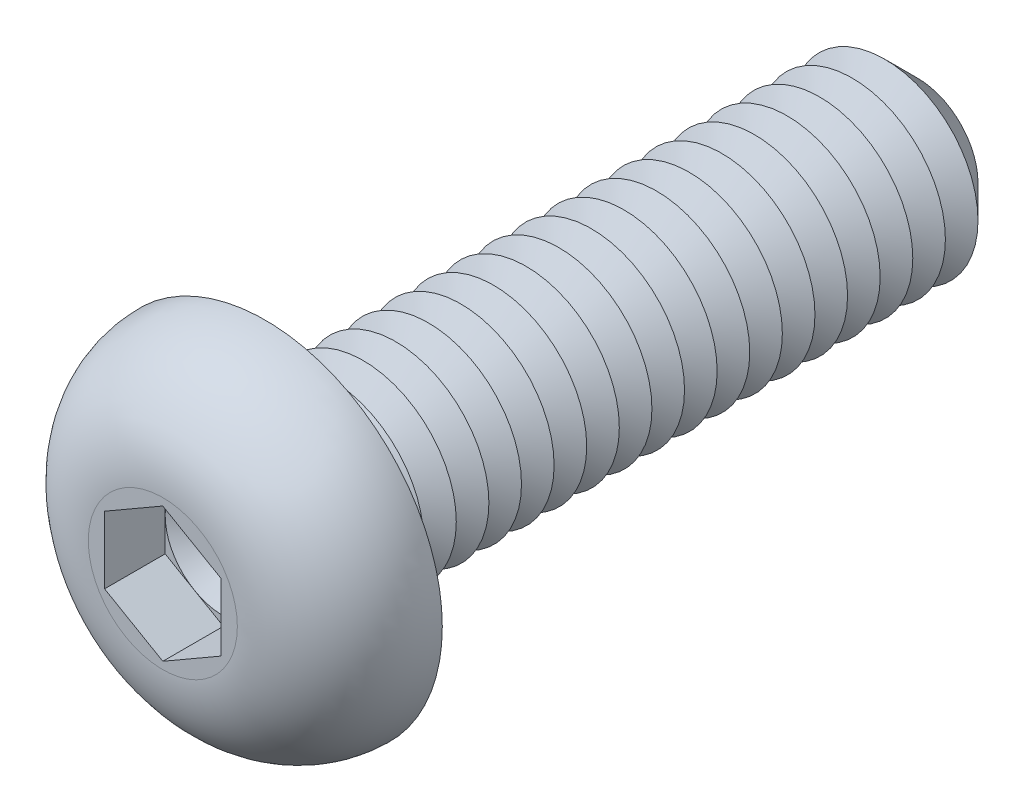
ISO-10303-21;
HEADER;
FILE_DESCRIPTION(('STEP AP214'),'2;1');
FILE_NAME('part.step','',(''),(''),'','','');
FILE_SCHEMA(('AUTOMOTIVE_DESIGN { 1 0 10303 214 1 1 1 1 }'));
ENDSEC;
DATA;
#1=APPLICATION_CONTEXT('core data for automotive mechanical design processes');
#2=APPLICATION_PROTOCOL_DEFINITION('international standard','automotive_design',2000,#1);
#3=PRODUCT_CONTEXT('',#1,'mechanical');
#4=PRODUCT('Part','Part','',(#3));
#5=PRODUCT_RELATED_PRODUCT_CATEGORY('part','',(#4));
#6=PRODUCT_DEFINITION_FORMATION('','',#4);
#7=PRODUCT_DEFINITION_CONTEXT('part definition',#1,'design');
#8=PRODUCT_DEFINITION('design','',#6,#7);
#9=PRODUCT_DEFINITION_SHAPE('','',#8);
#10=(LENGTH_UNIT() NAMED_UNIT(*) SI_UNIT(.MILLI.,.METRE.));
#11=(NAMED_UNIT(*) PLANE_ANGLE_UNIT() SI_UNIT($,.RADIAN.));
#12=(NAMED_UNIT(*) SI_UNIT($,.STERADIAN.) SOLID_ANGLE_UNIT());
#13=UNCERTAINTY_MEASURE_WITH_UNIT(LENGTH_MEASURE(1.E-05),#10,'distance_accuracy_value','');
#14=(GEOMETRIC_REPRESENTATION_CONTEXT(3) GLOBAL_UNCERTAINTY_ASSIGNED_CONTEXT((#13)) GLOBAL_UNIT_ASSIGNED_CONTEXT((#10,
#11,#12)) REPRESENTATION_CONTEXT('',''));
#15=CARTESIAN_POINT('',(0.,0.,0.));
#16=DIRECTION('',(0.,0.,1.));
#17=DIRECTION('',(1.,0.,0.));
#18=AXIS2_PLACEMENT_3D('',#15,#16,#17);
#19=CARTESIAN_POINT('',(0.,0.,0.900000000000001));
#20=DIRECTION('',(0.,0.,1.));
#21=DIRECTION('',(1.,0.,0.));
#22=AXIS2_PLACEMENT_3D('',#19,#20,#21);
#23=PLANE('',#22);
#24=CARTESIAN_POINT('',(0.,0.,0.900000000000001));
#25=DIRECTION('',(0.,0.,1.));
#26=DIRECTION('',(1.,0.,0.));
#27=AXIS2_PLACEMENT_3D('',#24,#25,#26);
#28=CIRCLE('',#27,1.25);
#29=CARTESIAN_POINT('',(1.25,0.,0.900000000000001));
#30=VERTEX_POINT('',#29);
#31=CARTESIAN_POINT('',(0.625,1.08253175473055,0.900000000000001));
#32=VERTEX_POINT('',#31);
#33=EDGE_CURVE('E117',#30,#32,#28,.T.);
#34=ORIENTED_EDGE('',*,*,#33,.F.);
#35=DIRECTION('',(0.,1.,0.));
#36=VECTOR('',#35,1.);
#37=CARTESIAN_POINT('',(1.25,-0.721687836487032,0.900000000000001));
#38=LINE('',#37,#36);
#39=CARTESIAN_POINT('',(1.25,0.721687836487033,0.900000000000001));
#40=VERTEX_POINT('',#39);
#41=EDGE_CURVE('E140',#30,#40,#38,.T.);
#42=ORIENTED_EDGE('',*,*,#41,.T.);
#43=DIRECTION('',(-0.866025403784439,0.5,0.));
#44=VECTOR('',#43,1.);
#45=CARTESIAN_POINT('',(1.25,0.721687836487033,0.900000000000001));
#46=LINE('',#45,#44);
#47=EDGE_CURVE('E135',#40,#32,#46,.T.);
#48=ORIENTED_EDGE('',*,*,#47,.T.);
#49=EDGE_LOOP('',(#34,#42,#48));
#50=FACE_BOUND('',#49,.T.);
#51=ADVANCED_FACE('F39',(#50),#23,.T.);
#52=CARTESIAN_POINT('',(0.,0.,0.900000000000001));
#53=DIRECTION('',(0.,0.,1.));
#54=DIRECTION('',(1.,0.,0.));
#55=AXIS2_PLACEMENT_3D('',#52,#53,#54);
#56=CIRCLE('',#55,1.25);
#57=CARTESIAN_POINT('',(-0.625,1.08253175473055,0.900000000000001));
#58=VERTEX_POINT('',#57);
#59=EDGE_CURVE('E11',#32,#58,#56,.T.);
#60=ORIENTED_EDGE('',*,*,#59,.F.);
#61=CARTESIAN_POINT('',(0.,1.44337567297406,0.900000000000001));
#62=VERTEX_POINT('',#61);
#63=EDGE_CURVE('E130',#32,#62,#46,.T.);
#64=ORIENTED_EDGE('',*,*,#63,.T.);
#65=DIRECTION('',(-0.866025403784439,-0.5,0.));
#66=VECTOR('',#65,1.);
#67=CARTESIAN_POINT('',(0.,1.44337567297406,0.900000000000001));
#68=LINE('',#67,#66);
#69=EDGE_CURVE('E132',#62,#58,#68,.T.);
#70=ORIENTED_EDGE('',*,*,#69,.T.);
#71=EDGE_LOOP('',(#60,#64,#70));
#72=FACE_BOUND('',#71,.T.);
#73=ADVANCED_FACE('F129',(#72),#23,.T.);
#74=CARTESIAN_POINT('',(-1.25,0.,0.900000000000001));
#75=VERTEX_POINT('',#74);
#76=EDGE_CURVE('E49',#58,#75,#56,.T.);
#77=ORIENTED_EDGE('',*,*,#76,.F.);
#78=CARTESIAN_POINT('',(-1.25,0.721687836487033,0.900000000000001));
#79=VERTEX_POINT('',#78);
#80=EDGE_CURVE('E143',#58,#79,#68,.T.);
#81=ORIENTED_EDGE('',*,*,#80,.T.);
#82=DIRECTION('',(0.,-1.,0.));
#83=VECTOR('',#82,1.);
#84=CARTESIAN_POINT('',(-1.25,0.721687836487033,0.900000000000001));
#85=LINE('',#84,#83);
#86=EDGE_CURVE('E154',#79,#75,#85,.T.);
#87=ORIENTED_EDGE('',*,*,#86,.T.);
#88=EDGE_LOOP('',(#77,#81,#87));
#89=FACE_BOUND('',#88,.T.);
#90=ADVANCED_FACE('F250',(#89),#23,.T.);
#91=CARTESIAN_POINT('',(-0.625,-1.08253175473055,0.900000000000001));
#92=VERTEX_POINT('',#91);
#93=EDGE_CURVE('E233',#75,#92,#56,.T.);
#94=ORIENTED_EDGE('',*,*,#93,.F.);
#95=CARTESIAN_POINT('',(-1.25,-0.721687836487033,0.900000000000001));
#96=VERTEX_POINT('',#95);
#97=EDGE_CURVE('E153',#75,#96,#85,.T.);
#98=ORIENTED_EDGE('',*,*,#97,.T.);
#99=DIRECTION('',(0.866025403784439,-0.5,0.));
#100=VECTOR('',#99,1.);
#101=CARTESIAN_POINT('',(-1.25,-0.721687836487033,0.900000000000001));
#102=LINE('',#101,#100);
#103=EDGE_CURVE('E159',#96,#92,#102,.T.);
#104=ORIENTED_EDGE('',*,*,#103,.T.);
#105=EDGE_LOOP('',(#94,#98,#104));
#106=FACE_BOUND('',#105,.T.);
#107=ADVANCED_FACE('F243',(#106),#23,.T.);
#108=CARTESIAN_POINT('',(0.625,-1.08253175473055,0.900000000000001));
#109=VERTEX_POINT('',#108);
#110=EDGE_CURVE('E56',#92,#109,#56,.T.);
#111=ORIENTED_EDGE('',*,*,#110,.F.);
#112=CARTESIAN_POINT('',(0.,-1.44337567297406,0.900000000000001));
#113=VERTEX_POINT('',#112);
#114=EDGE_CURVE('E158',#92,#113,#102,.T.);
#115=ORIENTED_EDGE('',*,*,#114,.T.);
#116=DIRECTION('',(0.866025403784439,0.5,0.));
#117=VECTOR('',#116,1.);
#118=CARTESIAN_POINT('',(0.,-1.44337567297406,0.900000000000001));
#119=LINE('',#118,#117);
#120=EDGE_CURVE('E164',#113,#109,#119,.T.);
#121=ORIENTED_EDGE('',*,*,#120,.T.);
#122=EDGE_LOOP('',(#111,#115,#121));
#123=FACE_BOUND('',#122,.T.);
#124=ADVANCED_FACE('F425',(#123),#23,.T.);
#125=CARTESIAN_POINT('',(0.,0.,-14.));
#126=DIRECTION('',(0.,0.,1.));
#127=DIRECTION('',(1.,0.,0.));
#128=AXIS2_PLACEMENT_3D('',#125,#126,#127);
#129=CYLINDRICAL_SURFACE('',#128,2.);
#130=CARTESIAN_POINT('',(0.,0.,-0.3));
#131=DIRECTION('',(0.,0.,1.));
#132=DIRECTION('',(1.,0.,0.));
#133=AXIS2_PLACEMENT_3D('',#130,#131,#132);
#134=CIRCLE('',#133,2.);
#135=CARTESIAN_POINT('',(2.,0.,-0.3));
#136=VERTEX_POINT('',#135);
#137=EDGE_CURVE('E221',#136,#136,#134,.F.);
#138=ORIENTED_EDGE('',*,*,#137,.T.);
#139=EDGE_LOOP('',(#138));
#140=FACE_BOUND('',#139,.T.);
#141=CARTESIAN_POINT('',(0.,0.,-0.699999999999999));
#142=DIRECTION('',(0.,0.,1.));
#143=DIRECTION('',(1.,0.,0.));
#144=AXIS2_PLACEMENT_3D('',#141,#142,#143);
#145=CIRCLE('',#144,2.);
#146=CARTESIAN_POINT('',(2.,0.,-0.699999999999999));
#147=VERTEX_POINT('',#146);
#148=EDGE_CURVE('E149',#147,#147,#145,.T.);
#149=ORIENTED_EDGE('',*,*,#148,.T.);
#150=EDGE_LOOP('',(#149));
#151=FACE_BOUND('',#150,.T.);
#152=ADVANCED_FACE('F409',(#140,#151),#129,.T.);
#153=CARTESIAN_POINT('',(0.,3.8,0.));
#154=DIRECTION('',(0.,0.,1.));
#155=DIRECTION('',(1.,0.,0.));
#156=AXIS2_PLACEMENT_3D('',#153,#154,#155);
#157=PLANE('',#156);
#158=CARTESIAN_POINT('',(0.,0.,0.));
#159=DIRECTION('',(0.,0.,1.));
#160=DIRECTION('',(1.,0.,0.));
#161=AXIS2_PLACEMENT_3D('',#158,#159,#160);
#162=CIRCLE('',#161,2.3);
#163=CARTESIAN_POINT('',(2.3,0.,0.));
#164=VERTEX_POINT('',#163);
#165=EDGE_CURVE('E224',#164,#164,#162,.T.);
#166=ORIENTED_EDGE('',*,*,#165,.T.);
#167=EDGE_LOOP('',(#166));
#168=FACE_BOUND('',#167,.T.);
#169=CARTESIAN_POINT('',(0.,0.,0.));
#170=DIRECTION('',(0.,0.,1.));
#171=DIRECTION('',(1.,0.,0.));
#172=AXIS2_PLACEMENT_3D('',#169,#170,#171);
#173=CIRCLE('',#172,3.8);
#174=CARTESIAN_POINT('',(3.8,0.,0.));
#175=VERTEX_POINT('',#174);
#176=EDGE_CURVE('E195',#175,#175,#173,.T.);
#177=ORIENTED_EDGE('',*,*,#176,.F.);
#178=EDGE_LOOP('',(#177));
#179=FACE_BOUND('',#178,.T.);
#180=ADVANCED_FACE('F455',(#168,#179),#157,.F.);
#181=CARTESIAN_POINT('',(0.,0.,2.2));
#182=DIRECTION('',(0.,0.,-1.));
#183=DIRECTION('',(-1.,0.,0.));
#184=AXIS2_PLACEMENT_3D('',#181,#182,#183);
#185=PLANE('',#184);
#186=DIRECTION('',(-0.866025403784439,-0.5,0.));
#187=VECTOR('',#186,1.);
#188=CARTESIAN_POINT('',(0.,1.44337567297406,2.2));
#189=LINE('',#188,#187);
#190=CARTESIAN_POINT('',(0.,1.44337567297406,2.2));
#191=VERTEX_POINT('',#190);
#192=CARTESIAN_POINT('',(-1.25,0.721687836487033,2.2));
#193=VERTEX_POINT('',#192);
#194=EDGE_CURVE('E174',#191,#193,#189,.T.);
#195=ORIENTED_EDGE('',*,*,#194,.F.);
#196=DIRECTION('',(-0.866025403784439,0.5,0.));
#197=VECTOR('',#196,1.);
#198=CARTESIAN_POINT('',(1.25,0.721687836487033,2.2));
#199=LINE('',#198,#197);
#200=CARTESIAN_POINT('',(1.25,0.721687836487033,2.2));
#201=VERTEX_POINT('',#200);
#202=EDGE_CURVE('E64',#201,#191,#199,.T.);
#203=ORIENTED_EDGE('',*,*,#202,.F.);
#204=DIRECTION('',(0.,1.,0.));
#205=VECTOR('',#204,1.);
#206=CARTESIAN_POINT('',(1.25,-0.721687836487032,2.2));
#207=LINE('',#206,#205);
#208=CARTESIAN_POINT('',(1.25,-0.721687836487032,2.2));
#209=VERTEX_POINT('',#208);
#210=EDGE_CURVE('E138',#209,#201,#207,.T.);
#211=ORIENTED_EDGE('',*,*,#210,.F.);
#212=DIRECTION('',(0.866025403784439,0.5,0.));
#213=VECTOR('',#212,1.);
#214=CARTESIAN_POINT('',(0.,-1.44337567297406,2.2));
#215=LINE('',#214,#213);
#216=CARTESIAN_POINT('',(0.,-1.44337567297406,2.2));
#217=VERTEX_POINT('',#216);
#218=EDGE_CURVE('E186',#217,#209,#215,.T.);
#219=ORIENTED_EDGE('',*,*,#218,.F.);
#220=DIRECTION('',(0.866025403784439,-0.5,0.));
#221=VECTOR('',#220,1.);
#222=CARTESIAN_POINT('',(-1.25,-0.721687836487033,2.2));
#223=LINE('',#222,#221);
#224=CARTESIAN_POINT('',(-1.25,-0.721687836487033,2.2));
#225=VERTEX_POINT('',#224);
#226=EDGE_CURVE('E182',#225,#217,#223,.T.);
#227=ORIENTED_EDGE('',*,*,#226,.F.);
#228=DIRECTION('',(0.,-1.,0.));
#229=VECTOR('',#228,1.);
#230=CARTESIAN_POINT('',(-1.25,0.721687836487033,2.2));
#231=LINE('',#230,#229);
#232=EDGE_CURVE('E178',#193,#225,#231,.T.);
#233=ORIENTED_EDGE('',*,*,#232,.F.);
#234=EDGE_LOOP('',(#195,#203,#211,#219,#227,#233));
#235=FACE_BOUND('',#234,.T.);
#236=CARTESIAN_POINT('',(0.,0.,2.2));
#237=DIRECTION('',(0.,0.,1.));
#238=DIRECTION('',(1.,0.,0.));
#239=AXIS2_PLACEMENT_3D('',#236,#237,#238);
#240=CIRCLE('',#239,1.6);
#241=CARTESIAN_POINT('',(1.6,0.,2.2));
#242=VERTEX_POINT('',#241);
#243=EDGE_CURVE('E213',#242,#242,#240,.T.);
#244=ORIENTED_EDGE('',*,*,#243,.T.);
#245=EDGE_LOOP('',(#244));
#246=FACE_BOUND('',#245,.T.);
#247=ADVANCED_FACE('F259',(#235,#246),#185,.F.);
#248=CARTESIAN_POINT('',(0.,0.,0.));
#249=DIRECTION('',(0.,0.,1.));
#250=DIRECTION('',(1.,0.,0.));
#251=AXIS2_PLACEMENT_3D('',#248,#249,#250);
#252=DEGENERATE_TOROIDAL_SURFACE('',#251,1.6,2.2,.T.);
#253=ORIENTED_EDGE('',*,*,#243,.F.);
#254=EDGE_LOOP('',(#253));
#255=FACE_BOUND('',#254,.T.);
#256=ORIENTED_EDGE('',*,*,#176,.T.);
#257=EDGE_LOOP('',(#256));
#258=FACE_BOUND('',#257,.T.);
#259=ADVANCED_FACE('F449',(#255,#258),#252,.T.);
#260=CARTESIAN_POINT('',(1.25,0.721687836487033,0.900000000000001));
#261=DIRECTION('',(0.5,0.866025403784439,0.));
#262=DIRECTION('',(-0.866025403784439,0.5,0.));
#263=AXIS2_PLACEMENT_3D('',#260,#261,#262);
#264=PLANE('',#263);
#265=ORIENTED_EDGE('',*,*,#202,.T.);
#266=DIRECTION('',(0.,0.,1.));
#267=VECTOR('',#266,1.);
#268=CARTESIAN_POINT('',(0.,1.44337567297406,0.900000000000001));
#269=LINE('',#268,#267);
#270=EDGE_CURVE('E136',#62,#191,#269,.T.);
#271=ORIENTED_EDGE('',*,*,#270,.F.);
#272=ORIENTED_EDGE('',*,*,#63,.F.);
#273=ORIENTED_EDGE('',*,*,#47,.F.);
#274=DIRECTION('',(0.,0.,1.));
#275=VECTOR('',#274,1.);
#276=CARTESIAN_POINT('',(1.25,0.721687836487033,0.900000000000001));
#277=LINE('',#276,#275);
#278=EDGE_CURVE('E193',#40,#201,#277,.T.);
#279=ORIENTED_EDGE('',*,*,#278,.T.);
#280=EDGE_LOOP('',(#265,#271,#272,#273,#279));
#281=FACE_BOUND('',#280,.T.);
#282=ADVANCED_FACE('F134',(#281),#264,.F.);
#283=CARTESIAN_POINT('',(1.25,-0.721687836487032,0.900000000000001));
#284=DIRECTION('',(1.,0.,0.));
#285=DIRECTION('',(0.,1.,0.));
#286=AXIS2_PLACEMENT_3D('',#283,#284,#285);
#287=PLANE('',#286);
#288=ORIENTED_EDGE('',*,*,#210,.T.);
#289=ORIENTED_EDGE('',*,*,#278,.F.);
#290=ORIENTED_EDGE('',*,*,#41,.F.);
#291=CARTESIAN_POINT('',(1.25,-0.721687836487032,0.900000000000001));
#292=VERTEX_POINT('',#291);
#293=EDGE_CURVE('E168',#292,#30,#38,.T.);
#294=ORIENTED_EDGE('',*,*,#293,.F.);
#295=DIRECTION('',(0.,0.,1.));
#296=VECTOR('',#295,1.);
#297=CARTESIAN_POINT('',(1.25,-0.721687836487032,0.900000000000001));
#298=LINE('',#297,#296);
#299=EDGE_CURVE('E196',#292,#209,#298,.T.);
#300=ORIENTED_EDGE('',*,*,#299,.T.);
#301=EDGE_LOOP('',(#288,#289,#290,#294,#300));
#302=FACE_BOUND('',#301,.T.);
#303=ADVANCED_FACE('F433',(#302),#287,.F.);
#304=CARTESIAN_POINT('',(0.,-1.44337567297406,0.900000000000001));
#305=DIRECTION('',(0.5,-0.866025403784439,0.));
#306=DIRECTION('',(0.866025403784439,0.5,0.));
#307=AXIS2_PLACEMENT_3D('',#304,#305,#306);
#308=PLANE('',#307);
#309=ORIENTED_EDGE('',*,*,#218,.T.);
#310=ORIENTED_EDGE('',*,*,#299,.F.);
#311=EDGE_CURVE('E163',#109,#292,#119,.T.);
#312=ORIENTED_EDGE('',*,*,#311,.F.);
#313=ORIENTED_EDGE('',*,*,#120,.F.);
#314=DIRECTION('',(0.,0.,1.));
#315=VECTOR('',#314,1.);
#316=CARTESIAN_POINT('',(0.,-1.44337567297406,0.900000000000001));
#317=LINE('',#316,#315);
#318=EDGE_CURVE('E199',#113,#217,#317,.T.);
#319=ORIENTED_EDGE('',*,*,#318,.T.);
#320=EDGE_LOOP('',(#309,#310,#312,#313,#319));
#321=FACE_BOUND('',#320,.T.);
#322=ADVANCED_FACE('F436',(#321),#308,.F.);
#323=CARTESIAN_POINT('',(-1.25,-0.721687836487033,0.900000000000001));
#324=DIRECTION('',(-0.5,-0.866025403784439,0.));
#325=DIRECTION('',(0.866025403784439,-0.5,0.));
#326=AXIS2_PLACEMENT_3D('',#323,#324,#325);
#327=PLANE('',#326);
#328=ORIENTED_EDGE('',*,*,#226,.T.);
#329=ORIENTED_EDGE('',*,*,#318,.F.);
#330=ORIENTED_EDGE('',*,*,#114,.F.);
#331=ORIENTED_EDGE('',*,*,#103,.F.);
#332=DIRECTION('',(0.,0.,1.));
#333=VECTOR('',#332,1.);
#334=CARTESIAN_POINT('',(-1.25,-0.721687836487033,0.900000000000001));
#335=LINE('',#334,#333);
#336=EDGE_CURVE('E202',#96,#225,#335,.T.);
#337=ORIENTED_EDGE('',*,*,#336,.T.);
#338=EDGE_LOOP('',(#328,#329,#330,#331,#337));
#339=FACE_BOUND('',#338,.T.);
#340=ADVANCED_FACE('F264',(#339),#327,.F.);
#341=CARTESIAN_POINT('',(-1.25,0.721687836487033,0.900000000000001));
#342=DIRECTION('',(-1.,0.,0.));
#343=DIRECTION('',(0.,0.,1.));
#344=AXIS2_PLACEMENT_3D('',#341,#342,#343);
#345=PLANE('',#344);
#346=ORIENTED_EDGE('',*,*,#232,.T.);
#347=ORIENTED_EDGE('',*,*,#336,.F.);
#348=ORIENTED_EDGE('',*,*,#97,.F.);
#349=ORIENTED_EDGE('',*,*,#86,.F.);
#350=DIRECTION('',(0.,0.,1.));
#351=VECTOR('',#350,1.);
#352=CARTESIAN_POINT('',(-1.25,0.721687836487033,0.900000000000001));
#353=LINE('',#352,#351);
#354=EDGE_CURVE('E205',#79,#193,#353,.T.);
#355=ORIENTED_EDGE('',*,*,#354,.T.);
#356=EDGE_LOOP('',(#346,#347,#348,#349,#355));
#357=FACE_BOUND('',#356,.T.);
#358=ADVANCED_FACE('F248',(#357),#345,.F.);
#359=CARTESIAN_POINT('',(0.,1.44337567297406,0.900000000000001));
#360=DIRECTION('',(-0.5,0.866025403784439,0.));
#361=DIRECTION('',(-0.866025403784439,-0.5,0.));
#362=AXIS2_PLACEMENT_3D('',#359,#360,#361);
#363=PLANE('',#362);
#364=ORIENTED_EDGE('',*,*,#194,.T.);
#365=ORIENTED_EDGE('',*,*,#354,.F.);
#366=ORIENTED_EDGE('',*,*,#80,.F.);
#367=ORIENTED_EDGE('',*,*,#69,.F.);
#368=ORIENTED_EDGE('',*,*,#270,.T.);
#369=EDGE_LOOP('',(#364,#365,#366,#367,#368));
#370=FACE_BOUND('',#369,.T.);
#371=ADVANCED_FACE('F253',(#370),#363,.F.);
#372=EDGE_CURVE('E43',#109,#30,#56,.T.);
#373=ORIENTED_EDGE('',*,*,#372,.F.);
#374=ORIENTED_EDGE('',*,*,#311,.T.);
#375=ORIENTED_EDGE('',*,*,#293,.T.);
#376=EDGE_LOOP('',(#373,#374,#375));
#377=FACE_BOUND('',#376,.T.);
#378=ADVANCED_FACE('F414',(#377),#23,.T.);
#379=CARTESIAN_POINT('',(0.,0.,-0.699999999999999));
#380=DIRECTION('',(0.,0.,1.));
#381=DIRECTION('',(1.,0.,0.));
#382=AXIS2_PLACEMENT_3D('',#379,#380,#381);
#383=CONICAL_SURFACE('',#382,2.,1.04719755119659);
#384=CARTESIAN_POINT('',(0.,0.,-1.05));
#385=DIRECTION('',(0.,0.,1.));
#386=DIRECTION('',(1.,0.,0.));
#387=AXIS2_PLACEMENT_3D('',#384,#385,#386);
#388=CIRCLE('',#387,1.3937822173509);
#389=CARTESIAN_POINT('',(1.3937822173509,0.,-1.05));
#390=VERTEX_POINT('',#389);
#391=EDGE_CURVE('E401',#390,#390,#388,.T.);
#392=ORIENTED_EDGE('',*,*,#391,.T.);
#393=EDGE_LOOP('',(#392));
#394=FACE_BOUND('',#393,.T.);
#395=ORIENTED_EDGE('',*,*,#148,.F.);
#396=EDGE_LOOP('',(#395));
#397=FACE_BOUND('',#396,.T.);
#398=ADVANCED_FACE('F411',(#394,#397),#383,.T.);
#399=CARTESIAN_POINT('',(0.,0.,-1.05));
#400=DIRECTION('',(0.,0.,-1.));
#401=DIRECTION('',(-1.,0.,0.));
#402=AXIS2_PLACEMENT_3D('',#399,#400,#401);
#403=CONICAL_SURFACE('',#402,1.3937822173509,1.0471975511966);
#404=CARTESIAN_POINT('',(0.,0.,-1.4));
#405=DIRECTION('',(0.,0.,1.));
#406=DIRECTION('',(1.,0.,0.));
#407=AXIS2_PLACEMENT_3D('',#404,#405,#406);
#408=CIRCLE('',#407,2.);
#409=CARTESIAN_POINT('',(2.,0.,-1.4));
#410=VERTEX_POINT('',#409);
#411=EDGE_CURVE('E399',#410,#410,#408,.T.);
#412=ORIENTED_EDGE('',*,*,#411,.T.);
#413=EDGE_LOOP('',(#412));
#414=FACE_BOUND('',#413,.T.);
#415=ORIENTED_EDGE('',*,*,#391,.F.);
#416=EDGE_LOOP('',(#415));
#417=FACE_BOUND('',#416,.T.);
#418=ADVANCED_FACE('F413',(#414,#417),#403,.T.);
#419=CARTESIAN_POINT('',(0.,0.,-1.4));
#420=DIRECTION('',(0.,0.,1.));
#421=DIRECTION('',(1.,0.,0.));
#422=AXIS2_PLACEMENT_3D('',#419,#420,#421);
#423=CONICAL_SURFACE('',#422,2.,1.04719755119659);
#424=CARTESIAN_POINT('',(0.,0.,-1.75));
#425=DIRECTION('',(0.,0.,1.));
#426=DIRECTION('',(1.,0.,0.));
#427=AXIS2_PLACEMENT_3D('',#424,#425,#426);
#428=CIRCLE('',#427,1.3937822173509);
#429=CARTESIAN_POINT('',(1.3937822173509,0.,-1.75));
#430=VERTEX_POINT('',#429);
#431=EDGE_CURVE('E334',#430,#430,#428,.T.);
#432=ORIENTED_EDGE('',*,*,#431,.T.);
#433=EDGE_LOOP('',(#432));
#434=FACE_BOUND('',#433,.T.);
#435=ORIENTED_EDGE('',*,*,#411,.F.);
#436=EDGE_LOOP('',(#435));
#437=FACE_BOUND('',#436,.T.);
#438=ADVANCED_FACE('F420',(#434,#437),#423,.T.);
#439=CARTESIAN_POINT('',(0.,0.,-1.75));
#440=DIRECTION('',(0.,0.,-1.));
#441=DIRECTION('',(-1.,0.,0.));
#442=AXIS2_PLACEMENT_3D('',#439,#440,#441);
#443=CONICAL_SURFACE('',#442,1.3937822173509,1.0471975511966);
#444=CARTESIAN_POINT('',(0.,0.,-2.1));
#445=DIRECTION('',(0.,0.,1.));
#446=DIRECTION('',(1.,0.,0.));
#447=AXIS2_PLACEMENT_3D('',#444,#445,#446);
#448=CIRCLE('',#447,2.);
#449=CARTESIAN_POINT('',(2.,0.,-2.1));
#450=VERTEX_POINT('',#449);
#451=EDGE_CURVE('E332',#450,#450,#448,.T.);
#452=ORIENTED_EDGE('',*,*,#451,.T.);
#453=EDGE_LOOP('',(#452));
#454=FACE_BOUND('',#453,.T.);
#455=ORIENTED_EDGE('',*,*,#431,.F.);
#456=EDGE_LOOP('',(#455));
#457=FACE_BOUND('',#456,.T.);
#458=ADVANCED_FACE('F601',(#454,#457),#443,.T.);
#459=CARTESIAN_POINT('',(0.,0.,-2.1));
#460=DIRECTION('',(0.,0.,1.));
#461=DIRECTION('',(1.,0.,0.));
#462=AXIS2_PLACEMENT_3D('',#459,#460,#461);
#463=CONICAL_SURFACE('',#462,2.,1.04719755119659);
#464=CARTESIAN_POINT('',(0.,0.,-2.45));
#465=DIRECTION('',(0.,0.,1.));
#466=DIRECTION('',(1.,0.,0.));
#467=AXIS2_PLACEMENT_3D('',#464,#465,#466);
#468=CIRCLE('',#467,1.3937822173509);
#469=CARTESIAN_POINT('',(1.3937822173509,0.,-2.45));
#470=VERTEX_POINT('',#469);
#471=EDGE_CURVE('E335',#470,#470,#468,.T.);
#472=ORIENTED_EDGE('',*,*,#471,.T.);
#473=EDGE_LOOP('',(#472));
#474=FACE_BOUND('',#473,.T.);
#475=ORIENTED_EDGE('',*,*,#451,.F.);
#476=EDGE_LOOP('',(#475));
#477=FACE_BOUND('',#476,.T.);
#478=ADVANCED_FACE('F597',(#474,#477),#463,.T.);
#479=CARTESIAN_POINT('',(0.,0.,-2.45));
#480=DIRECTION('',(0.,0.,-1.));
#481=DIRECTION('',(-1.,0.,0.));
#482=AXIS2_PLACEMENT_3D('',#479,#480,#481);
#483=CONICAL_SURFACE('',#482,1.3937822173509,1.0471975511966);
#484=CARTESIAN_POINT('',(0.,0.,-2.8));
#485=DIRECTION('',(0.,0.,1.));
#486=DIRECTION('',(1.,0.,0.));
#487=AXIS2_PLACEMENT_3D('',#484,#485,#486);
#488=CIRCLE('',#487,2.);
#489=CARTESIAN_POINT('',(2.,0.,-2.8));
#490=VERTEX_POINT('',#489);
#491=EDGE_CURVE('E349',#490,#490,#488,.T.);
#492=ORIENTED_EDGE('',*,*,#491,.T.);
#493=EDGE_LOOP('',(#492));
#494=FACE_BOUND('',#493,.T.);
#495=ORIENTED_EDGE('',*,*,#471,.F.);
#496=EDGE_LOOP('',(#495));
#497=FACE_BOUND('',#496,.T.);
#498=ADVANCED_FACE('F593',(#494,#497),#483,.T.);
#499=CARTESIAN_POINT('',(0.,0.,-2.8));
#500=DIRECTION('',(0.,0.,1.));
#501=DIRECTION('',(1.,0.,0.));
#502=AXIS2_PLACEMENT_3D('',#499,#500,#501);
#503=CONICAL_SURFACE('',#502,2.,1.04719755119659);
#504=CARTESIAN_POINT('',(0.,0.,-3.15));
#505=DIRECTION('',(0.,0.,1.));
#506=DIRECTION('',(1.,0.,0.));
#507=AXIS2_PLACEMENT_3D('',#504,#505,#506);
#508=CIRCLE('',#507,1.3937822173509);
#509=CARTESIAN_POINT('',(1.3937822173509,0.,-3.15));
#510=VERTEX_POINT('',#509);
#511=EDGE_CURVE('E346',#510,#510,#508,.T.);
#512=ORIENTED_EDGE('',*,*,#511,.T.);
#513=EDGE_LOOP('',(#512));
#514=FACE_BOUND('',#513,.T.);
#515=ORIENTED_EDGE('',*,*,#491,.F.);
#516=EDGE_LOOP('',(#515));
#517=FACE_BOUND('',#516,.T.);
#518=ADVANCED_FACE('F589',(#514,#517),#503,.T.);
#519=CARTESIAN_POINT('',(0.,0.,-3.15));
#520=DIRECTION('',(0.,0.,-1.));
#521=DIRECTION('',(-1.,0.,0.));
#522=AXIS2_PLACEMENT_3D('',#519,#520,#521);
#523=CONICAL_SURFACE('',#522,1.3937822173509,1.0471975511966);
#524=CARTESIAN_POINT('',(0.,0.,-3.5));
#525=DIRECTION('',(0.,0.,1.));
#526=DIRECTION('',(1.,0.,0.));
#527=AXIS2_PLACEMENT_3D('',#524,#525,#526);
#528=CIRCLE('',#527,2.);
#529=CARTESIAN_POINT('',(2.,0.,-3.5));
#530=VERTEX_POINT('',#529);
#531=EDGE_CURVE('E317',#530,#530,#528,.T.);
#532=ORIENTED_EDGE('',*,*,#531,.T.);
#533=EDGE_LOOP('',(#532));
#534=FACE_BOUND('',#533,.T.);
#535=ORIENTED_EDGE('',*,*,#511,.F.);
#536=EDGE_LOOP('',(#535));
#537=FACE_BOUND('',#536,.T.);
#538=ADVANCED_FACE('F585',(#534,#537),#523,.T.);
#539=CARTESIAN_POINT('',(0.,0.,-3.5));
#540=DIRECTION('',(0.,0.,1.));
#541=DIRECTION('',(1.,0.,0.));
#542=AXIS2_PLACEMENT_3D('',#539,#540,#541);
#543=CONICAL_SURFACE('',#542,2.,1.04719755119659);
#544=CARTESIAN_POINT('',(0.,0.,-3.85));
#545=DIRECTION('',(0.,0.,1.));
#546=DIRECTION('',(1.,0.,0.));
#547=AXIS2_PLACEMENT_3D('',#544,#545,#546);
#548=CIRCLE('',#547,1.3937822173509);
#549=CARTESIAN_POINT('',(1.3937822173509,0.,-3.85));
#550=VERTEX_POINT('',#549);
#551=EDGE_CURVE('E282',#550,#550,#548,.T.);
#552=ORIENTED_EDGE('',*,*,#551,.T.);
#553=EDGE_LOOP('',(#552));
#554=FACE_BOUND('',#553,.T.);
#555=ORIENTED_EDGE('',*,*,#531,.F.);
#556=EDGE_LOOP('',(#555));
#557=FACE_BOUND('',#556,.T.);
#558=ADVANCED_FACE('F581',(#554,#557),#543,.T.);
#559=CARTESIAN_POINT('',(0.,0.,-3.85));
#560=DIRECTION('',(0.,0.,-1.));
#561=DIRECTION('',(-1.,0.,0.));
#562=AXIS2_PLACEMENT_3D('',#559,#560,#561);
#563=CONICAL_SURFACE('',#562,1.3937822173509,1.0471975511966);
#564=CARTESIAN_POINT('',(0.,0.,-4.2));
#565=DIRECTION('',(0.,0.,1.));
#566=DIRECTION('',(1.,0.,0.));
#567=AXIS2_PLACEMENT_3D('',#564,#565,#566);
#568=CIRCLE('',#567,2.);
#569=CARTESIAN_POINT('',(2.,0.,-4.2));
#570=VERTEX_POINT('',#569);
#571=EDGE_CURVE('E280',#570,#570,#568,.T.);
#572=ORIENTED_EDGE('',*,*,#571,.T.);
#573=EDGE_LOOP('',(#572));
#574=FACE_BOUND('',#573,.T.);
#575=ORIENTED_EDGE('',*,*,#551,.F.);
#576=EDGE_LOOP('',(#575));
#577=FACE_BOUND('',#576,.T.);
#578=ADVANCED_FACE('F577',(#574,#577),#563,.T.);
#579=CARTESIAN_POINT('',(0.,0.,-4.2));
#580=DIRECTION('',(0.,0.,1.));
#581=DIRECTION('',(1.,0.,0.));
#582=AXIS2_PLACEMENT_3D('',#579,#580,#581);
#583=CONICAL_SURFACE('',#582,2.,1.04719755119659);
#584=CARTESIAN_POINT('',(0.,0.,-4.55));
#585=DIRECTION('',(0.,0.,1.));
#586=DIRECTION('',(1.,0.,0.));
#587=AXIS2_PLACEMENT_3D('',#584,#585,#586);
#588=CIRCLE('',#587,1.3937822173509);
#589=CARTESIAN_POINT('',(1.3937822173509,0.,-4.55));
#590=VERTEX_POINT('',#589);
#591=EDGE_CURVE('E283',#590,#590,#588,.T.);
#592=ORIENTED_EDGE('',*,*,#591,.T.);
#593=EDGE_LOOP('',(#592));
#594=FACE_BOUND('',#593,.T.);
#595=ORIENTED_EDGE('',*,*,#571,.F.);
#596=EDGE_LOOP('',(#595));
#597=FACE_BOUND('',#596,.T.);
#598=ADVANCED_FACE('F573',(#594,#597),#583,.T.);
#599=CARTESIAN_POINT('',(0.,0.,-4.55));
#600=DIRECTION('',(0.,0.,-1.));
#601=DIRECTION('',(-1.,0.,0.));
#602=AXIS2_PLACEMENT_3D('',#599,#600,#601);
#603=CONICAL_SURFACE('',#602,1.3937822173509,1.0471975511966);
#604=CARTESIAN_POINT('',(0.,0.,-4.9));
#605=DIRECTION('',(0.,0.,1.));
#606=DIRECTION('',(1.,0.,0.));
#607=AXIS2_PLACEMENT_3D('',#604,#605,#606);
#608=CIRCLE('',#607,2.);
#609=CARTESIAN_POINT('',(2.,0.,-4.9));
#610=VERTEX_POINT('',#609);
#611=EDGE_CURVE('E329',#610,#610,#608,.T.);
#612=ORIENTED_EDGE('',*,*,#611,.T.);
#613=EDGE_LOOP('',(#612));
#614=FACE_BOUND('',#613,.T.);
#615=ORIENTED_EDGE('',*,*,#591,.F.);
#616=EDGE_LOOP('',(#615));
#617=FACE_BOUND('',#616,.T.);
#618=ADVANCED_FACE('F569',(#614,#617),#603,.T.);
#619=CARTESIAN_POINT('',(0.,0.,-4.9));
#620=DIRECTION('',(0.,0.,1.));
#621=DIRECTION('',(1.,0.,0.));
#622=AXIS2_PLACEMENT_3D('',#619,#620,#621);
#623=CONICAL_SURFACE('',#622,2.,1.04719755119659);
#624=CARTESIAN_POINT('',(0.,0.,-5.25));
#625=DIRECTION('',(0.,0.,1.));
#626=DIRECTION('',(1.,0.,0.));
#627=AXIS2_PLACEMENT_3D('',#624,#625,#626);
#628=CIRCLE('',#627,1.3937822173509);
#629=CARTESIAN_POINT('',(1.3937822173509,0.,-5.25));
#630=VERTEX_POINT('',#629);
#631=EDGE_CURVE('E326',#630,#630,#628,.T.);
#632=ORIENTED_EDGE('',*,*,#631,.T.);
#633=EDGE_LOOP('',(#632));
#634=FACE_BOUND('',#633,.T.);
#635=ORIENTED_EDGE('',*,*,#611,.F.);
#636=EDGE_LOOP('',(#635));
#637=FACE_BOUND('',#636,.T.);
#638=ADVANCED_FACE('F565',(#634,#637),#623,.T.);
#639=CARTESIAN_POINT('',(0.,0.,-5.25));
#640=DIRECTION('',(0.,0.,-1.));
#641=DIRECTION('',(-1.,0.,0.));
#642=AXIS2_PLACEMENT_3D('',#639,#640,#641);
#643=CONICAL_SURFACE('',#642,1.3937822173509,1.0471975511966);
#644=CARTESIAN_POINT('',(0.,0.,-5.6));
#645=DIRECTION('',(0.,0.,1.));
#646=DIRECTION('',(1.,0.,0.));
#647=AXIS2_PLACEMENT_3D('',#644,#645,#646);
#648=CIRCLE('',#647,2.);
#649=CARTESIAN_POINT('',(2.,0.,-5.6));
#650=VERTEX_POINT('',#649);
#651=EDGE_CURVE('E330',#650,#650,#648,.T.);
#652=ORIENTED_EDGE('',*,*,#651,.T.);
#653=EDGE_LOOP('',(#652));
#654=FACE_BOUND('',#653,.T.);
#655=ORIENTED_EDGE('',*,*,#631,.F.);
#656=EDGE_LOOP('',(#655));
#657=FACE_BOUND('',#656,.T.);
#658=ADVANCED_FACE('F561',(#654,#657),#643,.T.);
#659=CARTESIAN_POINT('',(0.,0.,-5.6));
#660=DIRECTION('',(0.,0.,1.));
#661=DIRECTION('',(1.,0.,0.));
#662=AXIS2_PLACEMENT_3D('',#659,#660,#661);
#663=CONICAL_SURFACE('',#662,2.,1.04719755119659);
#664=CARTESIAN_POINT('',(0.,0.,-5.95));
#665=DIRECTION('',(0.,0.,1.));
#666=DIRECTION('',(1.,0.,0.));
#667=AXIS2_PLACEMENT_3D('',#664,#665,#666);
#668=CIRCLE('',#667,1.3937822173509);
#669=CARTESIAN_POINT('',(1.3937822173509,0.,-5.95));
#670=VERTEX_POINT('',#669);
#671=EDGE_CURVE('E377',#670,#670,#668,.T.);
#672=ORIENTED_EDGE('',*,*,#671,.T.);
#673=EDGE_LOOP('',(#672));
#674=FACE_BOUND('',#673,.T.);
#675=ORIENTED_EDGE('',*,*,#651,.F.);
#676=EDGE_LOOP('',(#675));
#677=FACE_BOUND('',#676,.T.);
#678=ADVANCED_FACE('F557',(#674,#677),#663,.T.);
#679=CARTESIAN_POINT('',(0.,0.,-5.95));
#680=DIRECTION('',(0.,0.,-1.));
#681=DIRECTION('',(-1.,0.,0.));
#682=AXIS2_PLACEMENT_3D('',#679,#680,#681);
#683=CONICAL_SURFACE('',#682,1.3937822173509,1.0471975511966);
#684=CARTESIAN_POINT('',(0.,0.,-6.3));
#685=DIRECTION('',(0.,0.,1.));
#686=DIRECTION('',(1.,0.,0.));
#687=AXIS2_PLACEMENT_3D('',#684,#685,#686);
#688=CIRCLE('',#687,2.);
#689=CARTESIAN_POINT('',(2.,0.,-6.3));
#690=VERTEX_POINT('',#689);
#691=EDGE_CURVE('E341',#690,#690,#688,.T.);
#692=ORIENTED_EDGE('',*,*,#691,.T.);
#693=EDGE_LOOP('',(#692));
#694=FACE_BOUND('',#693,.T.);
#695=ORIENTED_EDGE('',*,*,#671,.F.);
#696=EDGE_LOOP('',(#695));
#697=FACE_BOUND('',#696,.T.);
#698=ADVANCED_FACE('F553',(#694,#697),#683,.T.);
#699=CARTESIAN_POINT('',(0.,0.,-6.3));
#700=DIRECTION('',(0.,0.,1.));
#701=DIRECTION('',(1.,0.,0.));
#702=AXIS2_PLACEMENT_3D('',#699,#700,#701);
#703=CONICAL_SURFACE('',#702,2.,1.04719755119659);
#704=CARTESIAN_POINT('',(0.,0.,-6.65));
#705=DIRECTION('',(0.,0.,1.));
#706=DIRECTION('',(1.,0.,0.));
#707=AXIS2_PLACEMENT_3D('',#704,#705,#706);
#708=CIRCLE('',#707,1.3937822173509);
#709=CARTESIAN_POINT('',(1.3937822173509,0.,-6.65));
#710=VERTEX_POINT('',#709);
#711=EDGE_CURVE('E338',#710,#710,#708,.T.);
#712=ORIENTED_EDGE('',*,*,#711,.T.);
#713=EDGE_LOOP('',(#712));
#714=FACE_BOUND('',#713,.T.);
#715=ORIENTED_EDGE('',*,*,#691,.F.);
#716=EDGE_LOOP('',(#715));
#717=FACE_BOUND('',#716,.T.);
#718=ADVANCED_FACE('F549',(#714,#717),#703,.T.);
#719=CARTESIAN_POINT('',(0.,0.,-6.65));
#720=DIRECTION('',(0.,0.,-1.));
#721=DIRECTION('',(-1.,0.,0.));
#722=AXIS2_PLACEMENT_3D('',#719,#720,#721);
#723=CONICAL_SURFACE('',#722,1.3937822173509,1.0471975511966);
#724=CARTESIAN_POINT('',(0.,0.,-7.));
#725=DIRECTION('',(0.,0.,1.));
#726=DIRECTION('',(1.,0.,0.));
#727=AXIS2_PLACEMENT_3D('',#724,#725,#726);
#728=CIRCLE('',#727,2.);
#729=CARTESIAN_POINT('',(2.,0.,-7.));
#730=VERTEX_POINT('',#729);
#731=EDGE_CURVE('E342',#730,#730,#728,.T.);
#732=ORIENTED_EDGE('',*,*,#731,.T.);
#733=EDGE_LOOP('',(#732));
#734=FACE_BOUND('',#733,.T.);
#735=ORIENTED_EDGE('',*,*,#711,.F.);
#736=EDGE_LOOP('',(#735));
#737=FACE_BOUND('',#736,.T.);
#738=ADVANCED_FACE('F545',(#734,#737),#723,.T.);
#739=CARTESIAN_POINT('',(0.,0.,-7.));
#740=DIRECTION('',(0.,0.,1.));
#741=DIRECTION('',(1.,0.,0.));
#742=AXIS2_PLACEMENT_3D('',#739,#740,#741);
#743=CONICAL_SURFACE('',#742,2.,1.04719755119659);
#744=CARTESIAN_POINT('',(0.,0.,-7.35));
#745=DIRECTION('',(0.,0.,1.));
#746=DIRECTION('',(1.,0.,0.));
#747=AXIS2_PLACEMENT_3D('',#744,#745,#746);
#748=CIRCLE('',#747,1.3937822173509);
#749=CARTESIAN_POINT('',(1.3937822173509,0.,-7.35));
#750=VERTEX_POINT('',#749);
#751=EDGE_CURVE('E352',#750,#750,#748,.T.);
#752=ORIENTED_EDGE('',*,*,#751,.T.);
#753=EDGE_LOOP('',(#752));
#754=FACE_BOUND('',#753,.T.);
#755=ORIENTED_EDGE('',*,*,#731,.F.);
#756=EDGE_LOOP('',(#755));
#757=FACE_BOUND('',#756,.T.);
#758=ADVANCED_FACE('F541',(#754,#757),#743,.T.);
#759=CARTESIAN_POINT('',(0.,0.,-7.35));
#760=DIRECTION('',(0.,0.,-1.));
#761=DIRECTION('',(-1.,0.,0.));
#762=AXIS2_PLACEMENT_3D('',#759,#760,#761);
#763=CONICAL_SURFACE('',#762,1.3937822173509,1.0471975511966);
#764=CARTESIAN_POINT('',(0.,0.,-7.7));
#765=DIRECTION('',(0.,0.,1.));
#766=DIRECTION('',(1.,0.,0.));
#767=AXIS2_PLACEMENT_3D('',#764,#765,#766);
#768=CIRCLE('',#767,2.);
#769=CARTESIAN_POINT('',(2.,0.,-7.7));
#770=VERTEX_POINT('',#769);
#771=EDGE_CURVE('E307',#770,#770,#768,.T.);
#772=ORIENTED_EDGE('',*,*,#771,.T.);
#773=EDGE_LOOP('',(#772));
#774=FACE_BOUND('',#773,.T.);
#775=ORIENTED_EDGE('',*,*,#751,.F.);
#776=EDGE_LOOP('',(#775));
#777=FACE_BOUND('',#776,.T.);
#778=ADVANCED_FACE('F537',(#774,#777),#763,.T.);
#779=CARTESIAN_POINT('',(0.,0.,-7.7));
#780=DIRECTION('',(0.,0.,1.));
#781=DIRECTION('',(1.,0.,0.));
#782=AXIS2_PLACEMENT_3D('',#779,#780,#781);
#783=CONICAL_SURFACE('',#782,2.,1.04719755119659);
#784=CARTESIAN_POINT('',(0.,0.,-8.05));
#785=DIRECTION('',(0.,0.,1.));
#786=DIRECTION('',(1.,0.,0.));
#787=AXIS2_PLACEMENT_3D('',#784,#785,#786);
#788=CIRCLE('',#787,1.3937822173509);
#789=CARTESIAN_POINT('',(1.3937822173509,0.,-8.05));
#790=VERTEX_POINT('',#789);
#791=EDGE_CURVE('E304',#790,#790,#788,.T.);
#792=ORIENTED_EDGE('',*,*,#791,.T.);
#793=EDGE_LOOP('',(#792));
#794=FACE_BOUND('',#793,.T.);
#795=ORIENTED_EDGE('',*,*,#771,.F.);
#796=EDGE_LOOP('',(#795));
#797=FACE_BOUND('',#796,.T.);
#798=ADVANCED_FACE('F533',(#794,#797),#783,.T.);
#799=CARTESIAN_POINT('',(0.,0.,-8.05));
#800=DIRECTION('',(0.,0.,-1.));
#801=DIRECTION('',(-1.,0.,0.));
#802=AXIS2_PLACEMENT_3D('',#799,#800,#801);
#803=CONICAL_SURFACE('',#802,1.3937822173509,1.0471975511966);
#804=CARTESIAN_POINT('',(0.,0.,-8.4));
#805=DIRECTION('',(0.,0.,1.));
#806=DIRECTION('',(1.,0.,0.));
#807=AXIS2_PLACEMENT_3D('',#804,#805,#806);
#808=CIRCLE('',#807,2.);
#809=CARTESIAN_POINT('',(2.,0.,-8.4));
#810=VERTEX_POINT('',#809);
#811=EDGE_CURVE('E277',#810,#810,#808,.T.);
#812=ORIENTED_EDGE('',*,*,#811,.T.);
#813=EDGE_LOOP('',(#812));
#814=FACE_BOUND('',#813,.T.);
#815=ORIENTED_EDGE('',*,*,#791,.F.);
#816=EDGE_LOOP('',(#815));
#817=FACE_BOUND('',#816,.T.);
#818=ADVANCED_FACE('F529',(#814,#817),#803,.T.);
#819=CARTESIAN_POINT('',(0.,0.,-8.4));
#820=DIRECTION('',(0.,0.,1.));
#821=DIRECTION('',(1.,0.,0.));
#822=AXIS2_PLACEMENT_3D('',#819,#820,#821);
#823=CONICAL_SURFACE('',#822,2.,1.04719755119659);
#824=CARTESIAN_POINT('',(0.,0.,-8.75));
#825=DIRECTION('',(0.,0.,1.));
#826=DIRECTION('',(1.,0.,0.));
#827=AXIS2_PLACEMENT_3D('',#824,#825,#826);
#828=CIRCLE('',#827,1.3937822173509);
#829=CARTESIAN_POINT('',(1.3937822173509,0.,-8.75));
#830=VERTEX_POINT('',#829);
#831=EDGE_CURVE('E275',#830,#830,#828,.T.);
#832=ORIENTED_EDGE('',*,*,#831,.T.);
#833=EDGE_LOOP('',(#832));
#834=FACE_BOUND('',#833,.T.);
#835=ORIENTED_EDGE('',*,*,#811,.F.);
#836=EDGE_LOOP('',(#835));
#837=FACE_BOUND('',#836,.T.);
#838=ADVANCED_FACE('F525',(#834,#837),#823,.T.);
#839=CARTESIAN_POINT('',(0.,0.,-8.75));
#840=DIRECTION('',(0.,0.,-1.));
#841=DIRECTION('',(-1.,0.,0.));
#842=AXIS2_PLACEMENT_3D('',#839,#840,#841);
#843=CONICAL_SURFACE('',#842,1.3937822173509,1.0471975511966);
#844=CARTESIAN_POINT('',(0.,0.,-9.1));
#845=DIRECTION('',(0.,0.,1.));
#846=DIRECTION('',(1.,0.,0.));
#847=AXIS2_PLACEMENT_3D('',#844,#845,#846);
#848=CIRCLE('',#847,2.);
#849=CARTESIAN_POINT('',(2.,0.,-9.1));
#850=VERTEX_POINT('',#849);
#851=EDGE_CURVE('E272',#850,#850,#848,.T.);
#852=ORIENTED_EDGE('',*,*,#851,.T.);
#853=EDGE_LOOP('',(#852));
#854=FACE_BOUND('',#853,.T.);
#855=ORIENTED_EDGE('',*,*,#831,.F.);
#856=EDGE_LOOP('',(#855));
#857=FACE_BOUND('',#856,.T.);
#858=ADVANCED_FACE('F521',(#854,#857),#843,.T.);
#859=CARTESIAN_POINT('',(0.,0.,-9.1));
#860=DIRECTION('',(0.,0.,1.));
#861=DIRECTION('',(1.,0.,0.));
#862=AXIS2_PLACEMENT_3D('',#859,#860,#861);
#863=CONICAL_SURFACE('',#862,2.,1.04719755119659);
#864=CARTESIAN_POINT('',(0.,0.,-9.45));
#865=DIRECTION('',(0.,0.,1.));
#866=DIRECTION('',(1.,0.,0.));
#867=AXIS2_PLACEMENT_3D('',#864,#865,#866);
#868=CIRCLE('',#867,1.3937822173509);
#869=CARTESIAN_POINT('',(1.3937822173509,0.,-9.45));
#870=VERTEX_POINT('',#869);
#871=EDGE_CURVE('E269',#870,#870,#868,.T.);
#872=ORIENTED_EDGE('',*,*,#871,.T.);
#873=EDGE_LOOP('',(#872));
#874=FACE_BOUND('',#873,.T.);
#875=ORIENTED_EDGE('',*,*,#851,.F.);
#876=EDGE_LOOP('',(#875));
#877=FACE_BOUND('',#876,.T.);
#878=ADVANCED_FACE('F517',(#874,#877),#863,.T.);
#879=CARTESIAN_POINT('',(0.,0.,-9.45));
#880=DIRECTION('',(0.,0.,-1.));
#881=DIRECTION('',(-1.,0.,0.));
#882=AXIS2_PLACEMENT_3D('',#879,#880,#881);
#883=CONICAL_SURFACE('',#882,1.3937822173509,1.0471975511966);
#884=CARTESIAN_POINT('',(0.,0.,-9.8));
#885=DIRECTION('',(0.,0.,1.));
#886=DIRECTION('',(1.,0.,0.));
#887=AXIS2_PLACEMENT_3D('',#884,#885,#886);
#888=CIRCLE('',#887,2.);
#889=CARTESIAN_POINT('',(2.,0.,-9.8));
#890=VERTEX_POINT('',#889);
#891=EDGE_CURVE('E273',#890,#890,#888,.T.);
#892=ORIENTED_EDGE('',*,*,#891,.T.);
#893=EDGE_LOOP('',(#892));
#894=FACE_BOUND('',#893,.T.);
#895=ORIENTED_EDGE('',*,*,#871,.F.);
#896=EDGE_LOOP('',(#895));
#897=FACE_BOUND('',#896,.T.);
#898=ADVANCED_FACE('F514',(#894,#897),#883,.T.);
#899=CARTESIAN_POINT('',(0.,0.,-9.8));
#900=DIRECTION('',(0.,0.,1.));
#901=DIRECTION('',(1.,0.,0.));
#902=AXIS2_PLACEMENT_3D('',#899,#900,#901);
#903=CONICAL_SURFACE('',#902,2.,1.04719755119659);
#904=CARTESIAN_POINT('',(0.,0.,-10.15));
#905=DIRECTION('',(0.,0.,1.));
#906=DIRECTION('',(1.,0.,0.));
#907=AXIS2_PLACEMENT_3D('',#904,#905,#906);
#908=CIRCLE('',#907,1.3937822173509);
#909=CARTESIAN_POINT('',(1.3937822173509,0.,-10.15));
#910=VERTEX_POINT('',#909);
#911=EDGE_CURVE('E314',#910,#910,#908,.T.);
#912=ORIENTED_EDGE('',*,*,#911,.T.);
#913=EDGE_LOOP('',(#912));
#914=FACE_BOUND('',#913,.T.);
#915=ORIENTED_EDGE('',*,*,#891,.F.);
#916=EDGE_LOOP('',(#915));
#917=FACE_BOUND('',#916,.T.);
#918=ADVANCED_FACE('F510',(#914,#917),#903,.T.);
#919=CARTESIAN_POINT('',(0.,0.,-10.15));
#920=DIRECTION('',(0.,0.,-1.));
#921=DIRECTION('',(-1.,0.,0.));
#922=AXIS2_PLACEMENT_3D('',#919,#920,#921);
#923=CONICAL_SURFACE('',#922,1.3937822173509,1.0471975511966);
#924=CARTESIAN_POINT('',(0.,0.,-10.5));
#925=DIRECTION('',(0.,0.,1.));
#926=DIRECTION('',(1.,0.,0.));
#927=AXIS2_PLACEMENT_3D('',#924,#925,#926);
#928=CIRCLE('',#927,2.);
#929=CARTESIAN_POINT('',(2.,0.,-10.5));
#930=VERTEX_POINT('',#929);
#931=EDGE_CURVE('E311',#930,#930,#928,.T.);
#932=ORIENTED_EDGE('',*,*,#931,.T.);
#933=EDGE_LOOP('',(#932));
#934=FACE_BOUND('',#933,.T.);
#935=ORIENTED_EDGE('',*,*,#911,.F.);
#936=EDGE_LOOP('',(#935));
#937=FACE_BOUND('',#936,.T.);
#938=ADVANCED_FACE('F506',(#934,#937),#923,.T.);
#939=CARTESIAN_POINT('',(0.,0.,-10.5));
#940=DIRECTION('',(0.,0.,1.));
#941=DIRECTION('',(1.,0.,0.));
#942=AXIS2_PLACEMENT_3D('',#939,#940,#941);
#943=CONICAL_SURFACE('',#942,2.,1.04719755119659);
#944=CARTESIAN_POINT('',(0.,0.,-10.85));
#945=DIRECTION('',(0.,0.,1.));
#946=DIRECTION('',(1.,0.,0.));
#947=AXIS2_PLACEMENT_3D('',#944,#945,#946);
#948=CIRCLE('',#947,1.3937822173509);
#949=CARTESIAN_POINT('',(1.3937822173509,0.,-10.85));
#950=VERTEX_POINT('',#949);
#951=EDGE_CURVE('E294',#950,#950,#948,.T.);
#952=ORIENTED_EDGE('',*,*,#951,.T.);
#953=EDGE_LOOP('',(#952));
#954=FACE_BOUND('',#953,.T.);
#955=ORIENTED_EDGE('',*,*,#931,.F.);
#956=EDGE_LOOP('',(#955));
#957=FACE_BOUND('',#956,.T.);
#958=ADVANCED_FACE('F502',(#954,#957),#943,.T.);
#959=CARTESIAN_POINT('',(0.,0.,-10.85));
#960=DIRECTION('',(0.,0.,-1.));
#961=DIRECTION('',(-1.,0.,0.));
#962=AXIS2_PLACEMENT_3D('',#959,#960,#961);
#963=CONICAL_SURFACE('',#962,1.3937822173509,1.0471975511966);
#964=CARTESIAN_POINT('',(0.,0.,-11.2));
#965=DIRECTION('',(0.,0.,1.));
#966=DIRECTION('',(1.,0.,0.));
#967=AXIS2_PLACEMENT_3D('',#964,#965,#966);
#968=CIRCLE('',#967,2.);
#969=CARTESIAN_POINT('',(2.,0.,-11.2));
#970=VERTEX_POINT('',#969);
#971=EDGE_CURVE('E292',#970,#970,#968,.T.);
#972=ORIENTED_EDGE('',*,*,#971,.T.);
#973=EDGE_LOOP('',(#972));
#974=FACE_BOUND('',#973,.T.);
#975=ORIENTED_EDGE('',*,*,#951,.F.);
#976=EDGE_LOOP('',(#975));
#977=FACE_BOUND('',#976,.T.);
#978=ADVANCED_FACE('F496',(#974,#977),#963,.T.);
#979=CARTESIAN_POINT('',(0.,0.,-11.2));
#980=DIRECTION('',(0.,0.,1.));
#981=DIRECTION('',(1.,0.,0.));
#982=AXIS2_PLACEMENT_3D('',#979,#980,#981);
#983=CONICAL_SURFACE('',#982,2.,1.04719755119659);
#984=CARTESIAN_POINT('',(0.,0.,-11.55));
#985=DIRECTION('',(0.,0.,1.));
#986=DIRECTION('',(1.,0.,0.));
#987=AXIS2_PLACEMENT_3D('',#984,#985,#986);
#988=CIRCLE('',#987,1.3937822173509);
#989=CARTESIAN_POINT('',(1.3937822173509,0.,-11.55));
#990=VERTEX_POINT('',#989);
#991=EDGE_CURVE('E295',#990,#990,#988,.T.);
#992=ORIENTED_EDGE('',*,*,#991,.T.);
#993=EDGE_LOOP('',(#992));
#994=FACE_BOUND('',#993,.T.);
#995=ORIENTED_EDGE('',*,*,#971,.F.);
#996=EDGE_LOOP('',(#995));
#997=FACE_BOUND('',#996,.T.);
#998=ADVANCED_FACE('F481',(#994,#997),#983,.T.);
#999=CARTESIAN_POINT('',(0.,0.,-11.55));
#1000=DIRECTION('',(0.,0.,-1.));
#1001=DIRECTION('',(-1.,0.,0.));
#1002=AXIS2_PLACEMENT_3D('',#999,#1000,#1001);
#1003=CONICAL_SURFACE('',#1002,1.3937822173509,1.0471975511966);
#1004=CARTESIAN_POINT('',(0.,0.,-11.9));
#1005=DIRECTION('',(0.,0.,1.));
#1006=DIRECTION('',(1.,0.,0.));
#1007=AXIS2_PLACEMENT_3D('',#1004,#1005,#1006);
#1008=CIRCLE('',#1007,2.);
#1009=CARTESIAN_POINT('',(2.,0.,-11.9));
#1010=VERTEX_POINT('',#1009);
#1011=EDGE_CURVE('E300',#1010,#1010,#1008,.T.);
#1012=ORIENTED_EDGE('',*,*,#1011,.T.);
#1013=EDGE_LOOP('',(#1012));
#1014=FACE_BOUND('',#1013,.T.);
#1015=ORIENTED_EDGE('',*,*,#991,.F.);
#1016=EDGE_LOOP('',(#1015));
#1017=FACE_BOUND('',#1016,.T.);
#1018=ADVANCED_FACE('F484',(#1014,#1017),#1003,.T.);
#1019=CARTESIAN_POINT('',(0.,0.,-11.9));
#1020=DIRECTION('',(0.,0.,1.));
#1021=DIRECTION('',(1.,0.,0.));
#1022=AXIS2_PLACEMENT_3D('',#1019,#1020,#1021);
#1023=CONICAL_SURFACE('',#1022,2.,1.04719755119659);
#1024=CARTESIAN_POINT('',(0.,0.,-12.25));
#1025=DIRECTION('',(0.,0.,1.));
#1026=DIRECTION('',(1.,0.,0.));
#1027=AXIS2_PLACEMENT_3D('',#1024,#1025,#1026);
#1028=CIRCLE('',#1027,1.3937822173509);
#1029=CARTESIAN_POINT('',(1.3937822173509,0.,-12.25));
#1030=VERTEX_POINT('',#1029);
#1031=EDGE_CURVE('E289',#1030,#1030,#1028,.T.);
#1032=ORIENTED_EDGE('',*,*,#1031,.T.);
#1033=EDGE_LOOP('',(#1032));
#1034=FACE_BOUND('',#1033,.T.);
#1035=ORIENTED_EDGE('',*,*,#1011,.F.);
#1036=EDGE_LOOP('',(#1035));
#1037=FACE_BOUND('',#1036,.T.);
#1038=ADVANCED_FACE('F486',(#1034,#1037),#1023,.T.);
#1039=CARTESIAN_POINT('',(0.,0.,-12.25));
#1040=DIRECTION('',(0.,0.,-1.));
#1041=DIRECTION('',(-1.,0.,0.));
#1042=AXIS2_PLACEMENT_3D('',#1039,#1040,#1041);
#1043=CONICAL_SURFACE('',#1042,1.3937822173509,1.0471975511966);
#1044=CARTESIAN_POINT('',(0.,0.,-12.6));
#1045=DIRECTION('',(0.,0.,1.));
#1046=DIRECTION('',(1.,0.,0.));
#1047=AXIS2_PLACEMENT_3D('',#1044,#1045,#1046);
#1048=CIRCLE('',#1047,2.);
#1049=CARTESIAN_POINT('',(2.,0.,-12.6));
#1050=VERTEX_POINT('',#1049);
#1051=EDGE_CURVE('E286',#1050,#1050,#1048,.T.);
#1052=ORIENTED_EDGE('',*,*,#1051,.T.);
#1053=EDGE_LOOP('',(#1052));
#1054=FACE_BOUND('',#1053,.T.);
#1055=ORIENTED_EDGE('',*,*,#1031,.F.);
#1056=EDGE_LOOP('',(#1055));
#1057=FACE_BOUND('',#1056,.T.);
#1058=ADVANCED_FACE('F493',(#1054,#1057),#1043,.T.);
#1059=CARTESIAN_POINT('',(0.,0.,-12.6));
#1060=DIRECTION('',(0.,0.,1.));
#1061=DIRECTION('',(1.,0.,0.));
#1062=AXIS2_PLACEMENT_3D('',#1059,#1060,#1061);
#1063=CONICAL_SURFACE('',#1062,2.,1.04719755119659);
#1064=CARTESIAN_POINT('',(0.,0.,-12.95));
#1065=DIRECTION('',(0.,0.,1.));
#1066=DIRECTION('',(1.,0.,0.));
#1067=AXIS2_PLACEMENT_3D('',#1064,#1065,#1066);
#1068=CIRCLE('',#1067,1.3937822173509);
#1069=CARTESIAN_POINT('',(1.3937822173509,0.,-12.95));
#1070=VERTEX_POINT('',#1069);
#1071=EDGE_CURVE('E124',#1070,#1070,#1068,.T.);
#1072=ORIENTED_EDGE('',*,*,#1071,.T.);
#1073=EDGE_LOOP('',(#1072));
#1074=FACE_BOUND('',#1073,.T.);
#1075=ORIENTED_EDGE('',*,*,#1051,.F.);
#1076=EDGE_LOOP('',(#1075));
#1077=FACE_BOUND('',#1076,.T.);
#1078=ADVANCED_FACE('F716',(#1074,#1077),#1063,.T.);
#1079=CARTESIAN_POINT('',(0.,0.,-12.95));
#1080=DIRECTION('',(0.,0.,-1.));
#1081=DIRECTION('',(-1.,0.,0.));
#1082=AXIS2_PLACEMENT_3D('',#1079,#1080,#1081);
#1083=CONICAL_SURFACE('',#1082,1.3937822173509,1.0471975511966);
#1084=CARTESIAN_POINT('',(0.,0.,-13.3));
#1085=DIRECTION('',(0.,0.,1.));
#1086=DIRECTION('',(1.,0.,0.));
#1087=AXIS2_PLACEMENT_3D('',#1084,#1085,#1086);
#1088=CIRCLE('',#1087,2.);
#1089=CARTESIAN_POINT('',(2.,0.,-13.3));
#1090=VERTEX_POINT('',#1089);
#1091=EDGE_CURVE('E290',#1090,#1090,#1088,.T.);
#1092=ORIENTED_EDGE('',*,*,#1091,.T.);
#1093=EDGE_LOOP('',(#1092));
#1094=FACE_BOUND('',#1093,.T.);
#1095=ORIENTED_EDGE('',*,*,#1071,.F.);
#1096=EDGE_LOOP('',(#1095));
#1097=FACE_BOUND('',#1096,.T.);
#1098=ADVANCED_FACE('F466',(#1094,#1097),#1083,.T.);
#1099=CARTESIAN_POINT('',(0.,0.,-14.));
#1100=DIRECTION('',(0.,0.,-1.));
#1101=DIRECTION('',(-1.,0.,0.));
#1102=AXIS2_PLACEMENT_3D('',#1099,#1100,#1101);
#1103=PLANE('',#1102);
#1104=CARTESIAN_POINT('',(0.,0.,-14.));
#1105=DIRECTION('',(0.,0.,-1.));
#1106=DIRECTION('',(-1.,0.,0.));
#1107=AXIS2_PLACEMENT_3D('',#1104,#1105,#1106);
#1108=CIRCLE('',#1107,1.30000000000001);
#1109=CARTESIAN_POINT('',(1.30000000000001,0.,-14.));
#1110=VERTEX_POINT('',#1109);
#1111=EDGE_CURVE('E217',#1110,#1110,#1108,.T.);
#1112=ORIENTED_EDGE('',*,*,#1111,.T.);
#1113=EDGE_LOOP('',(#1112));
#1114=FACE_BOUND('',#1113,.T.);
#1115=ADVANCED_FACE('F459',(#1114),#1103,.T.);
#1116=CARTESIAN_POINT('',(0.,0.,-14.));
#1117=DIRECTION('',(0.,0.,1.));
#1118=DIRECTION('',(1.,0.,0.));
#1119=AXIS2_PLACEMENT_3D('',#1116,#1117,#1118);
#1120=CONICAL_SURFACE('',#1119,1.30000000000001,0.785398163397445);
#1121=CARTESIAN_POINT('',(2.,0.,-13.3));
#1122=CARTESIAN_POINT('',(1.99270833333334,0.,-13.3072916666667));
#1123=CARTESIAN_POINT('',(1.98541666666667,0.,-13.3145833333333));
#1124=CARTESIAN_POINT('',(1.97083333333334,0.,-13.3291666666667));
#1125=CARTESIAN_POINT('',(1.96354166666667,0.,-13.3364583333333));
#1126=CARTESIAN_POINT('',(1.94895833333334,0.,-13.3510416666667));
#1127=CARTESIAN_POINT('',(1.94166666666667,0.,-13.3583333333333));
#1128=CARTESIAN_POINT('',(1.92708333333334,0.,-13.3729166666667));
#1129=CARTESIAN_POINT('',(1.91979166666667,0.,-13.3802083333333));
#1130=CARTESIAN_POINT('',(1.90520833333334,0.,-13.3947916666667));
#1131=CARTESIAN_POINT('',(1.89791666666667,0.,-13.4020833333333));
#1132=CARTESIAN_POINT('',(1.88333333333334,0.,-13.4166666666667));
#1133=CARTESIAN_POINT('',(1.87604166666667,0.,-13.4239583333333));
#1134=CARTESIAN_POINT('',(1.86145833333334,0.,-13.4385416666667));
#1135=CARTESIAN_POINT('',(1.85416666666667,0.,-13.4458333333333));
#1136=CARTESIAN_POINT('',(1.83958333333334,0.,-13.4604166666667));
#1137=CARTESIAN_POINT('',(1.83229166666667,0.,-13.4677083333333));
#1138=CARTESIAN_POINT('',(1.81770833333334,0.,-13.4822916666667));
#1139=CARTESIAN_POINT('',(1.81041666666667,0.,-13.4895833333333));
#1140=CARTESIAN_POINT('',(1.79583333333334,0.,-13.5041666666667));
#1141=CARTESIAN_POINT('',(1.78854166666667,0.,-13.5114583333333));
#1142=CARTESIAN_POINT('',(1.77395833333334,0.,-13.5260416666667));
#1143=CARTESIAN_POINT('',(1.76666666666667,0.,-13.5333333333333));
#1144=CARTESIAN_POINT('',(1.75208333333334,0.,-13.5479166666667));
#1145=CARTESIAN_POINT('',(1.74479166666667,0.,-13.5552083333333));
#1146=CARTESIAN_POINT('',(1.73020833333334,0.,-13.5697916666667));
#1147=CARTESIAN_POINT('',(1.72291666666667,0.,-13.5770833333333));
#1148=CARTESIAN_POINT('',(1.70833333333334,0.,-13.5916666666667));
#1149=CARTESIAN_POINT('',(1.70104166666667,0.,-13.5989583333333));
#1150=CARTESIAN_POINT('',(1.68645833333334,0.,-13.6135416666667));
#1151=CARTESIAN_POINT('',(1.67916666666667,0.,-13.6208333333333));
#1152=CARTESIAN_POINT('',(1.66458333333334,0.,-13.6354166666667));
#1153=CARTESIAN_POINT('',(1.65729166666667,0.,-13.6427083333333));
#1154=CARTESIAN_POINT('',(1.64270833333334,0.,-13.6572916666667));
#1155=CARTESIAN_POINT('',(1.63541666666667,0.,-13.6645833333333));
#1156=CARTESIAN_POINT('',(1.62083333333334,0.,-13.6791666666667));
#1157=CARTESIAN_POINT('',(1.61354166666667,0.,-13.6864583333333));
#1158=CARTESIAN_POINT('',(1.59895833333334,0.,-13.7010416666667));
#1159=CARTESIAN_POINT('',(1.59166666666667,0.,-13.7083333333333));
#1160=CARTESIAN_POINT('',(1.57708333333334,0.,-13.7229166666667));
#1161=CARTESIAN_POINT('',(1.56979166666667,0.,-13.7302083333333));
#1162=CARTESIAN_POINT('',(1.55520833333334,0.,-13.7447916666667));
#1163=CARTESIAN_POINT('',(1.54791666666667,0.,-13.7520833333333));
#1164=CARTESIAN_POINT('',(1.53333333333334,0.,-13.7666666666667));
#1165=CARTESIAN_POINT('',(1.52604166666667,0.,-13.7739583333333));
#1166=CARTESIAN_POINT('',(1.51145833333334,0.,-13.7885416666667));
#1167=CARTESIAN_POINT('',(1.50416666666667,0.,-13.7958333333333));
#1168=CARTESIAN_POINT('',(1.48958333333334,0.,-13.8104166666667));
#1169=CARTESIAN_POINT('',(1.48229166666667,0.,-13.8177083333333));
#1170=CARTESIAN_POINT('',(1.46770833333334,0.,-13.8322916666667));
#1171=CARTESIAN_POINT('',(1.46041666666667,0.,-13.8395833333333));
#1172=CARTESIAN_POINT('',(1.44583333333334,0.,-13.8541666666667));
#1173=CARTESIAN_POINT('',(1.43854166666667,0.,-13.8614583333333));
#1174=CARTESIAN_POINT('',(1.42395833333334,0.,-13.8760416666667));
#1175=CARTESIAN_POINT('',(1.41666666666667,0.,-13.8833333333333));
#1176=CARTESIAN_POINT('',(1.40208333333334,0.,-13.8979166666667));
#1177=CARTESIAN_POINT('',(1.39479166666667,0.,-13.9052083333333));
#1178=CARTESIAN_POINT('',(1.38020833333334,0.,-13.9197916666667));
#1179=CARTESIAN_POINT('',(1.37291666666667,0.,-13.9270833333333));
#1180=CARTESIAN_POINT('',(1.35833333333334,0.,-13.9416666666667));
#1181=CARTESIAN_POINT('',(1.35104166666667,0.,-13.9489583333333));
#1182=CARTESIAN_POINT('',(1.33645833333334,0.,-13.9635416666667));
#1183=CARTESIAN_POINT('',(1.32916666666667,0.,-13.9708333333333));
#1184=CARTESIAN_POINT('',(1.31458333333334,0.,-13.9854166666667));
#1185=CARTESIAN_POINT('',(1.30729166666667,0.,-13.9927083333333));
#1186=CARTESIAN_POINT('',(1.30000000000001,0.,-14.));
#1187=B_SPLINE_CURVE_WITH_KNOTS('',3,(#1121,#1122,#1123,#1124,#1125,#1126,#1127,#1128,#1129,
#1130,#1131,#1132,#1133,#1134,#1135,#1136,#1137,#1138,#1139,#1140,#1141,#1142,#1143,#1144,#1145,
#1146,#1147,#1148,#1149,#1150,#1151,#1152,#1153,#1154,#1155,#1156,#1157,#1158,#1159,#1160,#1161,
#1162,#1163,#1164,#1165,#1166,#1167,#1168,#1169,#1170,#1171,#1172,#1173,#1174,#1175,#1176,#1177,
#1178,#1179,#1180,#1181,#1182,#1183,#1184,#1185,#1186),.UNSPECIFIED.,.F.,.F.,(4,2,2,2,2,2,2,2,2,
2,2,2,2,2,2,2,2,2,2,2,2,2,2,2,2,2,2,2,2,2,2,2,4),(0.,0.0309359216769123,0.0618718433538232,
0.0928077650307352,0.123743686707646,0.154679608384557,0.185615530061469,0.21655145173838,
0.247487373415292,0.278423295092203,0.309359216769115,0.340295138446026,0.371231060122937,
0.402166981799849,0.43310290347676,0.464038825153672,0.494974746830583,0.525910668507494,
0.556846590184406,0.587782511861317,0.618718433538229,0.64965435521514,0.680590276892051,
0.711526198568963,0.742462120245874,0.773398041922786,0.804333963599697,0.835269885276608,
0.86620580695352,0.897141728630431,0.928077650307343,0.959013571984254,0.989949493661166),.UNSPECIFIED.);
#1188=EDGE_CURVE('BSEAM457',#1090,#1110,#1187,.T.);
#1189=ORIENTED_EDGE('',*,*,#1091,.F.);
#1190=ORIENTED_EDGE('',*,*,#1111,.F.);
#1191=ORIENTED_EDGE('',*,*,#1188,.T.);
#1192=ORIENTED_EDGE('',*,*,#1188,.F.);
#1193=EDGE_LOOP('',(#1189,#1191,#1190,#1192));
#1194=FACE_BOUND('',#1193,.T.);
#1195=ADVANCED_FACE('F457',(#1194),#1120,.T.);
#1196=CARTESIAN_POINT('',(0.,0.,-0.3));
#1197=DIRECTION('',(0.,0.,1.));
#1198=DIRECTION('',(1.,0.,0.));
#1199=AXIS2_PLACEMENT_3D('',#1196,#1197,#1198);
#1200=TOROIDAL_SURFACE('',#1199,2.3,0.3);
#1201=ORIENTED_EDGE('',*,*,#165,.F.);
#1202=EDGE_LOOP('',(#1201));
#1203=FACE_BOUND('',#1202,.T.);
#1204=ORIENTED_EDGE('',*,*,#137,.F.);
#1205=EDGE_LOOP('',(#1204));
#1206=FACE_BOUND('',#1205,.T.);
#1207=ADVANCED_FACE('F41',(#1203,#1206),#1200,.F.);
#1208=CARTESIAN_POINT('',(0.,0.,0.900000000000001));
#1209=DIRECTION('',(0.,0.,1.));
#1210=DIRECTION('',(1.,0.,0.));
#1211=AXIS2_PLACEMENT_3D('',#1208,#1209,#1210);
#1212=CONICAL_SURFACE('',#1211,1.25,1.0471975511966);
#1213=CARTESIAN_POINT('',(0.,0.,0.178312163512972));
#1214=VERTEX_POINT('',#1213);
#1215=VERTEX_LOOP('',#1214);
#1216=FACE_BOUND('',#1215,.T.);
#1217=ORIENTED_EDGE('',*,*,#33,.T.);
#1218=ORIENTED_EDGE('',*,*,#59,.T.);
#1219=ORIENTED_EDGE('',*,*,#76,.T.);
#1220=ORIENTED_EDGE('',*,*,#93,.T.);
#1221=ORIENTED_EDGE('',*,*,#110,.T.);
#1222=ORIENTED_EDGE('',*,*,#372,.T.);
#1223=EDGE_LOOP('',(#1217,#1218,#1219,#1220,#1221,#1222));
#1224=FACE_BOUND('',#1223,.T.);
#1225=ADVANCED_FACE('F113',(#1216,#1224),#1212,.F.);
#1226=CLOSED_SHELL('',(#51,#73,#90,#107,#124,#152,#180,#247,#259,#282,#303,#322,#340,#358,#371,
#378,#398,#418,#438,#458,#478,#498,#518,#538,#558,#578,#598,#618,#638,#658,#678,#698,#718,#738,
#758,#778,#798,#818,#838,#858,#878,#898,#918,#938,#958,#978,#998,#1018,#1038,#1058,#1078,#1098,
#1115,#1195,#1207,#1225));
#1227=MANIFOLD_SOLID_BREP('B2',#1226);
#1228=ADVANCED_BREP_SHAPE_REPRESENTATION('',(#18,#1227),#14);
#1229=SHAPE_DEFINITION_REPRESENTATION(#9,#1228);
ENDSEC;
END-ISO-10303-21;
